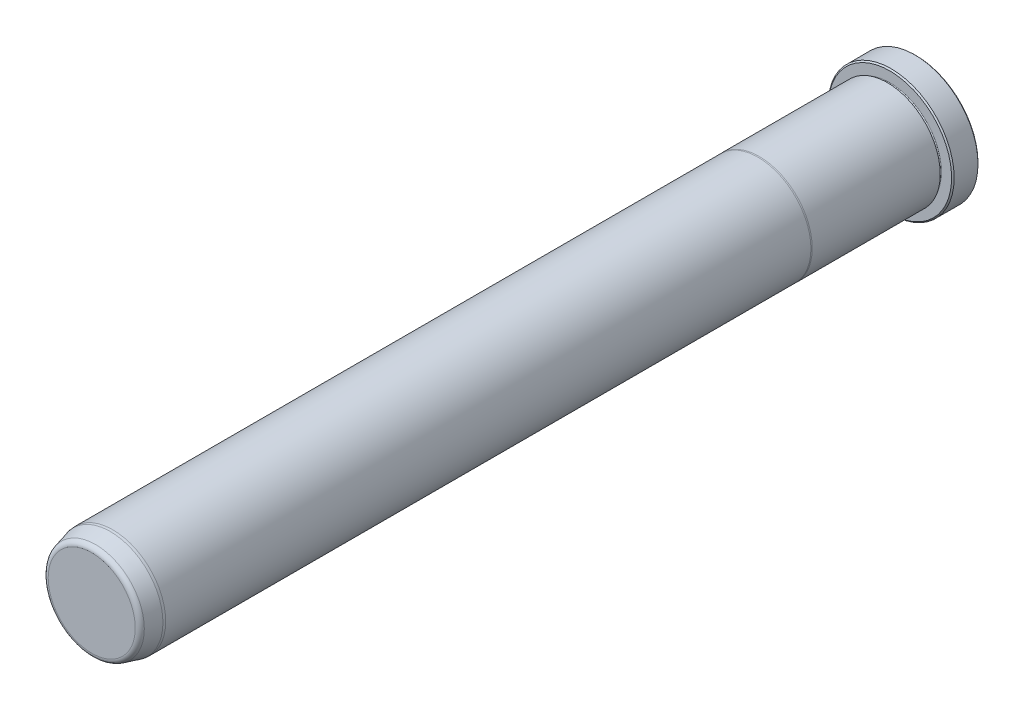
from build123d import *

# Parameters (mm, degrees)
FILLET6_R     = 1.5875
CHAMFER1_SIZE = 0.381


with BuildPart() as part:
    # Sketch1 → Revolve1 (revolve)
    with BuildSketch(Plane(origin=(0, 0, 0), x_dir=(0, 0, -1), z_dir=(1, 0, 0)), mode=Mode.PRIVATE) as revolve1_sk:
        with BuildLine():
            Line((0, 0), (0, 18.923))
            Line((0, 18.923), (-7.9248, 18.923))
            Line((-7.9248, 18.923), (-7.9248, 15.4813))
            ThreePointArc((-7.9248, 15.4813), (-8.3058, 15.1003), (-8.6868, 15.4813))
            Line((-8.6868, 15.4813), (-8.6868, 15.8877))
            Line((-8.6868, 15.8877), (-47.134763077, 15.8877))
            Line((-47.134763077, 15.8877), (-47.498, 15.8623))
            Line((-47.498, 15.8623), (-241.3, 15.8623))
            Line((-241.3, 15.8623), (-242.062, 15.795633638))
            Line((-242.062, 15.795633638), (-247.65, 14.298333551))
            Line((-247.65, 14.298333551), (-247.65, 0))
            Line((-247.65, 0), (0, 0))
        make_face()
    revolve(revolve1_sk.sketch.rotate(Axis((0, 0, 0), (0, 0, -1)), 90), axis=Axis((0, 0, 0), (0, 0, -1)))

    # Fillet6
    fillet6_edges = [part.edges().sort_by_distance(p)[0] for p in [
        (-14.298333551, 0, 247.65),
    ]]
    fillet(fillet6_edges, radius=FILLET6_R)

    # Chamfer1
    chamfer1_edges = [part.edges().sort_by_distance(p)[0] for p in [
        (-18.923, 0, 7.9248),
        (-18.923, 0, 0),
    ]]
    chamfer(chamfer1_edges, length=CHAMFER1_SIZE)


solid = part.part
